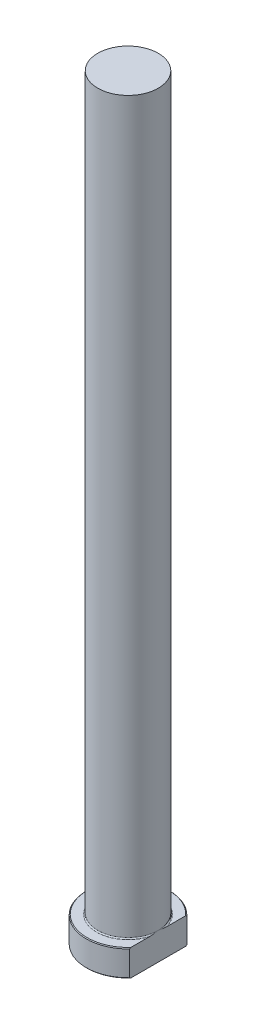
ISO-10303-21;
HEADER;
FILE_DESCRIPTION(('STEP AP214'),'2;1');
FILE_NAME('part.step','',(''),(''),'','','');
FILE_SCHEMA(('AUTOMOTIVE_DESIGN { 1 0 10303 214 1 1 1 1 }'));
ENDSEC;
DATA;
#1=APPLICATION_CONTEXT('core data for automotive mechanical design processes');
#2=APPLICATION_PROTOCOL_DEFINITION('international standard','automotive_design',2000,#1);
#3=PRODUCT_CONTEXT('',#1,'mechanical');
#4=PRODUCT('Part','Part','',(#3));
#5=PRODUCT_RELATED_PRODUCT_CATEGORY('part','',(#4));
#6=PRODUCT_DEFINITION_FORMATION('','',#4);
#7=PRODUCT_DEFINITION_CONTEXT('part definition',#1,'design');
#8=PRODUCT_DEFINITION('design','',#6,#7);
#9=PRODUCT_DEFINITION_SHAPE('','',#8);
#10=(LENGTH_UNIT() NAMED_UNIT(*) SI_UNIT(.MILLI.,.METRE.));
#11=(NAMED_UNIT(*) PLANE_ANGLE_UNIT() SI_UNIT($,.RADIAN.));
#12=(NAMED_UNIT(*) SI_UNIT($,.STERADIAN.) SOLID_ANGLE_UNIT());
#13=UNCERTAINTY_MEASURE_WITH_UNIT(LENGTH_MEASURE(1.E-05),#10,'distance_accuracy_value','');
#14=(GEOMETRIC_REPRESENTATION_CONTEXT(3) GLOBAL_UNCERTAINTY_ASSIGNED_CONTEXT((#13)) GLOBAL_UNIT_ASSIGNED_CONTEXT((#10,
#11,#12)) REPRESENTATION_CONTEXT('',''));
#15=CARTESIAN_POINT('',(0.,0.,0.));
#16=DIRECTION('',(0.,0.,1.));
#17=DIRECTION('',(1.,0.,0.));
#18=AXIS2_PLACEMENT_3D('',#15,#16,#17);
#19=CARTESIAN_POINT('',(0.,0.,0.));
#20=DIRECTION('',(0.,-1.,0.));
#21=DIRECTION('',(0.,0.,-1.));
#22=AXIS2_PLACEMENT_3D('',#19,#20,#21);
#23=PLANE('',#22);
#24=CARTESIAN_POINT('',(0.,0.,0.));
#25=DIRECTION('',(0.,-1.,0.));
#26=DIRECTION('',(0.,0.,-1.));
#27=AXIS2_PLACEMENT_3D('',#24,#25,#26);
#28=CIRCLE('',#27,10.7999999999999);
#29=CARTESIAN_POINT('',(7.99999999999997,0.,7.25534285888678));
#30=VERTEX_POINT('',#29);
#31=CARTESIAN_POINT('',(7.99999999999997,0.,-7.25534285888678));
#32=VERTEX_POINT('',#31);
#33=EDGE_CURVE('E98',#30,#32,#28,.T.);
#34=ORIENTED_EDGE('',*,*,#33,.T.);
#35=DIRECTION('',(0.,0.,1.));
#36=VECTOR('',#35,1.);
#37=CARTESIAN_POINT('',(7.99999999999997,0.,-7.54983443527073));
#38=LINE('',#37,#36);
#39=EDGE_CURVE('E83',#32,#30,#38,.T.);
#40=ORIENTED_EDGE('',*,*,#39,.T.);
#41=EDGE_LOOP('',(#34,#40));
#42=FACE_BOUND('',#41,.T.);
#43=ADVANCED_FACE('F32',(#42),#23,.T.);
#44=CARTESIAN_POINT('',(0.,259.958771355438,0.));
#45=DIRECTION('',(0.,1.,0.));
#46=DIRECTION('',(0.,0.,1.));
#47=AXIS2_PLACEMENT_3D('',#44,#45,#46);
#48=CYLINDRICAL_SURFACE('',#47,11.);
#49=CARTESIAN_POINT('',(0.,6.79999999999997,0.));
#50=DIRECTION('',(0.,1.,0.));
#51=DIRECTION('',(0.,0.,1.));
#52=AXIS2_PLACEMENT_3D('',#49,#50,#51);
#53=CIRCLE('',#52,11.);
#54=CARTESIAN_POINT('',(7.99999999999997,6.79999999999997,7.54983443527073));
#55=VERTEX_POINT('',#54);
#56=CARTESIAN_POINT('',(7.99999999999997,6.79999999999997,-7.54983443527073));
#57=VERTEX_POINT('',#56);
#58=EDGE_CURVE('E104',#55,#57,#53,.F.);
#59=ORIENTED_EDGE('',*,*,#58,.T.);
#60=DIRECTION('',(0.,-1.,0.));
#61=VECTOR('',#60,1.);
#62=CARTESIAN_POINT('',(7.99999999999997,200.,-7.54983443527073));
#63=LINE('',#62,#61);
#64=CARTESIAN_POINT('',(7.99999999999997,0.200000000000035,-7.54983443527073));
#65=VERTEX_POINT('',#64);
#66=EDGE_CURVE('E183',#57,#65,#63,.T.);
#67=ORIENTED_EDGE('',*,*,#66,.T.);
#68=CARTESIAN_POINT('',(0.,0.200000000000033,0.));
#69=DIRECTION('',(0.,-1.,0.));
#70=DIRECTION('',(0.,0.,-1.));
#71=AXIS2_PLACEMENT_3D('',#68,#69,#70);
#72=CIRCLE('',#71,11.);
#73=CARTESIAN_POINT('',(7.99999999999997,0.200000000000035,7.54983443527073));
#74=VERTEX_POINT('',#73);
#75=EDGE_CURVE('E100',#65,#74,#72,.F.);
#76=ORIENTED_EDGE('',*,*,#75,.T.);
#77=DIRECTION('',(0.,-1.,0.));
#78=VECTOR('',#77,1.);
#79=CARTESIAN_POINT('',(7.99999999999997,200.,7.54983443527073));
#80=LINE('',#79,#78);
#81=EDGE_CURVE('E93',#55,#74,#80,.T.);
#82=ORIENTED_EDGE('',*,*,#81,.F.);
#83=EDGE_LOOP('',(#59,#67,#76,#82));
#84=FACE_BOUND('',#83,.T.);
#85=ADVANCED_FACE('F158',(#84),#48,.T.);
#86=CARTESIAN_POINT('',(-11.,7.,0.));
#87=DIRECTION('',(0.,1.,0.));
#88=DIRECTION('',(0.,0.,1.));
#89=AXIS2_PLACEMENT_3D('',#86,#87,#88);
#90=PLANE('',#89);
#91=CARTESIAN_POINT('',(0.,7.,0.));
#92=DIRECTION('',(0.,1.,0.));
#93=DIRECTION('',(0.,0.,1.));
#94=AXIS2_PLACEMENT_3D('',#91,#92,#93);
#95=CIRCLE('',#94,10.8);
#96=CARTESIAN_POINT('',(7.99999999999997,7.,-7.25534285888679));
#97=VERTEX_POINT('',#96);
#98=CARTESIAN_POINT('',(7.99999999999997,7.,7.25534285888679));
#99=VERTEX_POINT('',#98);
#100=EDGE_CURVE('E178',#97,#99,#95,.T.);
#101=ORIENTED_EDGE('',*,*,#100,.T.);
#102=DIRECTION('',(0.,0.,-1.));
#103=VECTOR('',#102,1.);
#104=CARTESIAN_POINT('',(7.99999999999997,7.,0.));
#105=LINE('',#104,#103);
#106=CARTESIAN_POINT('',(7.99999999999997,6.99999999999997,2.21133443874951));
#107=VERTEX_POINT('',#106);
#108=EDGE_CURVE('E57',#99,#107,#105,.T.);
#109=ORIENTED_EDGE('',*,*,#108,.T.);
#110=CARTESIAN_POINT('',(0.,7.,0.));
#111=DIRECTION('',(0.,1.,0.));
#112=DIRECTION('',(0.,0.,1.));
#113=AXIS2_PLACEMENT_3D('',#110,#111,#112);
#114=CIRCLE('',#113,8.29999999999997);
#115=CARTESIAN_POINT('',(7.99999999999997,6.99999999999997,-2.21133443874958));
#116=VERTEX_POINT('',#115);
#117=EDGE_CURVE('E107',#107,#116,#114,.F.);
#118=ORIENTED_EDGE('',*,*,#117,.T.);
#119=EDGE_CURVE('E136',#116,#97,#105,.T.);
#120=ORIENTED_EDGE('',*,*,#119,.T.);
#121=EDGE_LOOP('',(#101,#109,#118,#120));
#122=FACE_BOUND('',#121,.T.);
#123=ADVANCED_FACE('F147',(#122),#90,.T.);
#124=CARTESIAN_POINT('',(0.,7.00000000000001,0.));
#125=DIRECTION('',(0.,-1.,0.));
#126=DIRECTION('',(0.,0.,-1.));
#127=AXIS2_PLACEMENT_3D('',#124,#125,#126);
#128=CONICAL_SURFACE('',#127,10.7999999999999,0.785398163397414);
#129=ORIENTED_EDGE('',*,*,#58,.F.);
#130=CARTESIAN_POINT('',(7.99999999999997,-0.636730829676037,16.6106304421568));
#131=CARTESIAN_POINT('',(7.99999999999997,-0.418611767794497,16.3685283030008));
#132=CARTESIAN_POINT('',(7.99999999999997,-0.200984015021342,16.1259843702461));
#133=CARTESIAN_POINT('',(7.99999999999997,0.233148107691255,15.6398927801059));
#134=CARTESIAN_POINT('',(7.99999999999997,0.449652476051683,15.3963451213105));
#135=CARTESIAN_POINT('',(7.99999999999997,1.09739989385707,14.6638687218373));
#136=CARTESIAN_POINT('',(7.99999999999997,1.52674426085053,14.1732538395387));
#137=CARTESIAN_POINT('',(7.99999999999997,2.16792810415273,13.4304656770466));
#138=CARTESIAN_POINT('',(7.99999999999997,2.38226067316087,13.180443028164));
#139=CARTESIAN_POINT('',(7.99999999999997,2.80892954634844,12.6787083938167));
#140=CARTESIAN_POINT('',(7.99999999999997,3.02126589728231,12.4269964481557));
#141=CARTESIAN_POINT('',(7.99999999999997,3.44357020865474,11.9216744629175));
#142=CARTESIAN_POINT('',(7.99999999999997,3.6535386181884,11.6680647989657));
#143=CARTESIAN_POINT('',(7.99999999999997,4.07074862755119,11.1585723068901));
#144=CARTESIAN_POINT('',(7.99999999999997,4.27798998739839,10.9026892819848));
#145=CARTESIAN_POINT('',(7.99999999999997,4.66965190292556,10.4127607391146));
#146=CARTESIAN_POINT('',(7.99999999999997,4.85436868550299,10.1789522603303));
#147=CARTESIAN_POINT('',(7.99999999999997,5.22063517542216,9.70886883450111));
#148=CARTESIAN_POINT('',(7.99999999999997,5.4021849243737,9.47259391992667));
#149=CARTESIAN_POINT('',(7.99999999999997,5.76149237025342,8.99721569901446));
#150=CARTESIAN_POINT('',(7.99999999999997,5.93925050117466,8.75811272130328));
#151=CARTESIAN_POINT('',(7.99999999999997,6.29022306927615,8.276601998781));
#152=CARTESIAN_POINT('',(7.99999999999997,6.46343768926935,8.03419438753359));
#153=CARTESIAN_POINT('',(7.99999999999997,6.80398487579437,7.54604999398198));
#154=CARTESIAN_POINT('',(7.99999999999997,6.97132935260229,7.3003215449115));
#155=CARTESIAN_POINT('',(7.99999999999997,7.29928849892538,6.80437777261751));
#156=CARTESIAN_POINT('',(7.99999999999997,7.45990280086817,6.55416220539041));
#157=CARTESIAN_POINT('',(7.99999999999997,7.77264940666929,6.04873149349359));
#158=CARTESIAN_POINT('',(7.99999999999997,7.92478824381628,5.79352041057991));
#159=CARTESIAN_POINT('',(7.99999999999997,8.21859570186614,5.27715744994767));
#160=CARTESIAN_POINT('',(7.99999999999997,8.36026610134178,5.01600659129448));
#161=CARTESIAN_POINT('',(7.99999999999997,8.62213596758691,4.50319242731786));
#162=CARTESIAN_POINT('',(7.99999999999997,8.74311989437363,4.25193242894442));
#163=CARTESIAN_POINT('',(7.99999999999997,8.97065709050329,3.74287674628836));
#164=CARTESIAN_POINT('',(7.99999999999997,9.07720941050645,3.48508063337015));
#165=CARTESIAN_POINT('',(7.99999999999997,9.27220860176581,2.96337495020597));
#166=CARTESIAN_POINT('',(7.99999999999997,9.36069936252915,2.69948197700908));
#167=CARTESIAN_POINT('',(7.99999999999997,9.51604316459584,2.16542713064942));
#168=CARTESIAN_POINT('',(7.99999999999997,9.58290677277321,1.89526838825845));
#169=CARTESIAN_POINT('',(7.99999999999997,9.68291221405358,1.39216000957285));
#170=CARTESIAN_POINT('',(7.99999999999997,9.71967474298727,1.15993430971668));
#171=CARTESIAN_POINT('',(7.99999999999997,9.77336730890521,0.69319665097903));
#172=CARTESIAN_POINT('',(7.99999999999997,9.7903003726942,0.458685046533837));
#173=CARTESIAN_POINT('',(7.99999999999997,9.8034285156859,-0.0106727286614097));
#174=CARTESIAN_POINT('',(7.99999999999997,9.79964609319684,-0.245518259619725));
#175=CARTESIAN_POINT('',(7.99999999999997,9.77160926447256,-0.713989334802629));
#176=CARTESIAN_POINT('',(7.99999999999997,9.74735189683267,-0.94761469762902));
#177=CARTESIAN_POINT('',(7.99999999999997,9.67070830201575,-1.47287443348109));
#178=CARTESIAN_POINT('',(7.99999999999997,9.61261890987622,-1.76367634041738));
#179=CARTESIAN_POINT('',(7.99999999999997,9.46982192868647,-2.33873282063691));
#180=CARTESIAN_POINT('',(7.99999999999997,9.38509750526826,-2.62298313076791));
#181=CARTESIAN_POINT('',(7.99999999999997,9.24134311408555,-3.04436856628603));
#182=CARTESIAN_POINT('',(7.99999999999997,9.19048552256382,-3.18437323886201));
#183=CARTESIAN_POINT('',(7.99999999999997,9.0838167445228,-3.4624156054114));
#184=CARTESIAN_POINT('',(7.99999999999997,9.0280078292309,-3.60045416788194));
#185=CARTESIAN_POINT('',(7.99999999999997,8.91195481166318,-3.87463242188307));
#186=CARTESIAN_POINT('',(7.99999999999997,8.85171106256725,-4.01077226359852));
#187=CARTESIAN_POINT('',(7.99999999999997,8.72725899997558,-4.28124317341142));
#188=CARTESIAN_POINT('',(7.99999999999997,8.66305017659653,-4.41557400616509));
#189=CARTESIAN_POINT('',(7.99999999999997,8.48984738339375,-4.76597692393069));
#190=CARTESIAN_POINT('',(7.99999999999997,8.37796178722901,-4.98062176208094));
#191=CARTESIAN_POINT('',(7.99999999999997,8.14649205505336,-5.40573762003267));
#192=CARTESIAN_POINT('',(7.99999999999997,8.02690659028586,-5.61620791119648));
#193=CARTESIAN_POINT('',(7.99999999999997,7.78128707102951,-6.03349586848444));
#194=CARTESIAN_POINT('',(7.99999999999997,7.65524949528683,-6.24031145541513));
#195=CARTESIAN_POINT('',(7.99999999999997,7.39783636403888,-6.65060320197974));
#196=CARTESIAN_POINT('',(7.99999999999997,7.26646042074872,-6.85407911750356));
#197=CARTESIAN_POINT('',(7.99999999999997,6.99890352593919,-7.25856399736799));
#198=CARTESIAN_POINT('',(7.99999999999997,6.86271149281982,-7.45956561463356));
#199=CARTESIAN_POINT('',(7.99999999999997,6.58651908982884,-7.85893907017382));
#200=CARTESIAN_POINT('',(7.99999999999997,6.4465185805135,-8.05731081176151));
#201=CARTESIAN_POINT('',(7.99999999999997,6.02178241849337,-8.6488124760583));
#202=CARTESIAN_POINT('',(7.99999999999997,5.73221467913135,-9.03847436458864));
#203=CARTESIAN_POINT('',(7.99999999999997,5.14234581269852,-9.8121850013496));
#204=CARTESIAN_POINT('',(7.99999999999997,4.84200393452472,-10.1962024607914));
#205=CARTESIAN_POINT('',(7.99999999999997,4.23404813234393,-10.9584616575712));
#206=CARTESIAN_POINT('',(7.99999999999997,3.92643376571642,-11.336703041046));
#207=CARTESIAN_POINT('',(7.99999999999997,3.30600745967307,-12.0880358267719));
#208=CARTESIAN_POINT('',(7.99999999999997,2.99320302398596,-12.4611334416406));
#209=CARTESIAN_POINT('',(7.99999999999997,2.36317801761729,-13.2035599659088));
#210=CARTESIAN_POINT('',(7.99999999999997,2.04595754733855,-13.5728889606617));
#211=CARTESIAN_POINT('',(7.99999999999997,1.33644011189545,-14.3909378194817));
#212=CARTESIAN_POINT('',(7.99999999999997,0.943258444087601,-14.8388897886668));
#213=CARTESIAN_POINT('',(7.99999999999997,0.35148359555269,-15.506812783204));
#214=CARTESIAN_POINT('',(7.99999999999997,0.154449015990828,-15.7281687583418));
#215=CARTESIAN_POINT('',(7.99999999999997,-0.240498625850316,-16.1700151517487));
#216=CARTESIAN_POINT('',(7.99999999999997,-0.438411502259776,-16.390505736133));
#217=CARTESIAN_POINT('',(7.99999999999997,-0.636730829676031,-16.6106304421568));
#218=B_SPLINE_CURVE_WITH_KNOTS('',3,(#130,#131,#132,#133,#134,#135,#136,#137,#138,#139,#140,
#141,#142,#143,#144,#145,#146,#147,#148,#149,#150,#151,#152,#153,#154,#155,#156,#157,#158,#159,
#160,#161,#162,#163,#164,#165,#166,#167,#168,#169,#170,#171,#172,#173,#174,#175,#176,#177,#178,
#179,#180,#181,#182,#183,#184,#185,#186,#187,#188,#189,#190,#191,#192,#193,#194,#195,#196,#197,
#198,#199,#200,#201,#202,#203,#204,#205,#206,#207,#208,#209,#210,#211,#212,#213,#214,#215,#216,
#217),.UNSPECIFIED.,.F.,.F.,(4,2,2,2,2,2,2,2,2,2,2,2,2,2,2,2,2,2,2,2,2,2,2,2,2,2,2,2,2,2,2,2,2,
2,2,2,2,2,2,2,2,2,2,4),(0.,0.977598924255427,1.95519922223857,3.91099512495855,4.89893858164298,
5.88685884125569,6.87458847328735,7.86240445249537,8.75629469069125,9.65017317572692,
10.5439487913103,11.4376883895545,12.3294952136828,13.2213506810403,14.1125088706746,
15.0035153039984,15.8397621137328,16.6760639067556,17.5103086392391,18.3441451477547,
19.0487229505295,19.7531931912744,20.4568984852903,21.1607055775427,22.0488428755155,
22.9375426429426,23.3843335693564,23.830920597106,24.2774720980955,24.72408114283,
25.4500411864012,26.1761268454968,26.902613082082,27.6291521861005,28.3574884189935,
29.0858513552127,30.5420520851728,32.0045059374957,33.4670490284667,34.9276355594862,
36.3881889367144,38.1762452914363,39.0652821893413,39.9541391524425),.UNSPECIFIED.);
#219=EDGE_CURVE('E135',#55,#99,#218,.T.);
#220=ORIENTED_EDGE('',*,*,#219,.T.);
#221=ORIENTED_EDGE('',*,*,#100,.F.);
#222=EDGE_CURVE('E127',#97,#57,#218,.T.);
#223=ORIENTED_EDGE('',*,*,#222,.T.);
#224=EDGE_LOOP('',(#129,#220,#221,#223));
#225=FACE_BOUND('',#224,.T.);
#226=ADVANCED_FACE('F143',(#225),#128,.T.);
#227=CARTESIAN_POINT('',(0.,0.200000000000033,0.));
#228=DIRECTION('',(0.,1.,0.));
#229=DIRECTION('',(0.,0.,1.));
#230=AXIS2_PLACEMENT_3D('',#227,#228,#229);
#231=CONICAL_SURFACE('',#230,11.,0.785398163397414);
#232=ORIENTED_EDGE('',*,*,#75,.F.);
#233=CARTESIAN_POINT('',(7.99999999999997,7.63673082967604,-16.6106304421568));
#234=CARTESIAN_POINT('',(7.99999999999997,7.4186117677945,-16.3685283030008));
#235=CARTESIAN_POINT('',(7.99999999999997,7.20098401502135,-16.1259843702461));
#236=CARTESIAN_POINT('',(7.99999999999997,6.76685189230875,-15.6398927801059));
#237=CARTESIAN_POINT('',(7.99999999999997,6.55034752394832,-15.3963451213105));
#238=CARTESIAN_POINT('',(7.99999999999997,5.90260010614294,-14.6638687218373));
#239=CARTESIAN_POINT('',(7.99999999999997,5.47325573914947,-14.1732538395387));
#240=CARTESIAN_POINT('',(7.99999999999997,4.83207189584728,-13.4304656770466));
#241=CARTESIAN_POINT('',(7.99999999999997,4.61773932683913,-13.180443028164));
#242=CARTESIAN_POINT('',(7.99999999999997,4.19107045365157,-12.6787083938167));
#243=CARTESIAN_POINT('',(7.99999999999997,3.9787341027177,-12.4269964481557));
#244=CARTESIAN_POINT('',(7.99999999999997,3.55642979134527,-11.9216744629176));
#245=CARTESIAN_POINT('',(7.99999999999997,3.34646138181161,-11.6680647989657));
#246=CARTESIAN_POINT('',(7.99999999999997,2.92925137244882,-11.1585723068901));
#247=CARTESIAN_POINT('',(7.99999999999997,2.72201001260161,-10.9026892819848));
#248=CARTESIAN_POINT('',(7.99999999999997,2.33034809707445,-10.4127607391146));
#249=CARTESIAN_POINT('',(7.99999999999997,2.14563131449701,-10.1789522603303));
#250=CARTESIAN_POINT('',(7.99999999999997,1.77936482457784,-9.70886883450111));
#251=CARTESIAN_POINT('',(7.99999999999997,1.59781507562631,-9.47259391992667));
#252=CARTESIAN_POINT('',(7.99999999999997,1.23850762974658,-8.99721569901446));
#253=CARTESIAN_POINT('',(7.99999999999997,1.06074949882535,-8.75811272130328));
#254=CARTESIAN_POINT('',(7.99999999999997,0.709776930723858,-8.276601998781));
#255=CARTESIAN_POINT('',(7.99999999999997,0.536562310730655,-8.03419438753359));
#256=CARTESIAN_POINT('',(7.99999999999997,0.196015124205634,-7.54604999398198));
#257=CARTESIAN_POINT('',(7.99999999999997,0.0286706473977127,-7.3003215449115));
#258=CARTESIAN_POINT('',(7.99999999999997,-0.299288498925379,-6.80437777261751));
#259=CARTESIAN_POINT('',(7.99999999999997,-0.459902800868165,-6.55416220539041));
#260=CARTESIAN_POINT('',(7.99999999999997,-0.772649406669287,-6.04873149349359));
#261=CARTESIAN_POINT('',(7.99999999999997,-0.924788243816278,-5.7935204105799));
#262=CARTESIAN_POINT('',(7.99999999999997,-1.21859570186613,-5.27715744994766));
#263=CARTESIAN_POINT('',(7.99999999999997,-1.36026610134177,-5.01600659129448));
#264=CARTESIAN_POINT('',(7.99999999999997,-1.62213596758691,-4.50319242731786));
#265=CARTESIAN_POINT('',(7.99999999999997,-1.74311989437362,-4.25193242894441));
#266=CARTESIAN_POINT('',(7.99999999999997,-1.97065709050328,-3.74287674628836));
#267=CARTESIAN_POINT('',(7.99999999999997,-2.07720941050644,-3.48508063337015));
#268=CARTESIAN_POINT('',(7.99999999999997,-2.27220860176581,-2.96337495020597));
#269=CARTESIAN_POINT('',(7.99999999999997,-2.36069936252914,-2.69948197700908));
#270=CARTESIAN_POINT('',(7.99999999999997,-2.51604316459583,-2.16542713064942));
#271=CARTESIAN_POINT('',(7.99999999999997,-2.58290677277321,-1.89526838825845));
#272=CARTESIAN_POINT('',(7.99999999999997,-2.68291221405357,-1.39216000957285));
#273=CARTESIAN_POINT('',(7.99999999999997,-2.71967474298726,-1.15993430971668));
#274=CARTESIAN_POINT('',(7.99999999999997,-2.77336730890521,-0.693196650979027));
#275=CARTESIAN_POINT('',(7.99999999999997,-2.7903003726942,-0.458685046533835));
#276=CARTESIAN_POINT('',(7.99999999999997,-2.80342851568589,0.0106727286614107));
#277=CARTESIAN_POINT('',(7.99999999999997,-2.79964609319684,0.245518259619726));
#278=CARTESIAN_POINT('',(7.99999999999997,-2.77160926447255,0.71398933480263));
#279=CARTESIAN_POINT('',(7.99999999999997,-2.74735189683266,0.94761469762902));
#280=CARTESIAN_POINT('',(7.99999999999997,-2.67070830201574,1.47287443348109));
#281=CARTESIAN_POINT('',(7.99999999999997,-2.61261890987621,1.76367634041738));
#282=CARTESIAN_POINT('',(7.99999999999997,-2.46982192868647,2.33873282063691));
#283=CARTESIAN_POINT('',(7.99999999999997,-2.38509750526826,2.62298313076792));
#284=CARTESIAN_POINT('',(7.99999999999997,-2.24134311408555,3.04436856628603));
#285=CARTESIAN_POINT('',(7.99999999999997,-2.19048552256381,3.184373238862));
#286=CARTESIAN_POINT('',(7.99999999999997,-2.08381674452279,3.46241560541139));
#287=CARTESIAN_POINT('',(7.99999999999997,-2.02800782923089,3.60045416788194));
#288=CARTESIAN_POINT('',(7.99999999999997,-1.91195481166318,3.87463242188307));
#289=CARTESIAN_POINT('',(7.99999999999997,-1.85171106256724,4.01077226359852));
#290=CARTESIAN_POINT('',(7.99999999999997,-1.72725899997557,4.28124317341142));
#291=CARTESIAN_POINT('',(7.99999999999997,-1.66305017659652,4.4155740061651));
#292=CARTESIAN_POINT('',(7.99999999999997,-1.48984738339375,4.76597692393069));
#293=CARTESIAN_POINT('',(7.99999999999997,-1.377961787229,4.98062176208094));
#294=CARTESIAN_POINT('',(7.99999999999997,-1.14649205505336,5.40573762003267));
#295=CARTESIAN_POINT('',(7.99999999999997,-1.02690659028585,5.61620791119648));
#296=CARTESIAN_POINT('',(7.99999999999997,-0.781287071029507,6.03349586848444));
#297=CARTESIAN_POINT('',(7.99999999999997,-0.655249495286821,6.24031145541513));
#298=CARTESIAN_POINT('',(7.99999999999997,-0.397836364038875,6.65060320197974));
#299=CARTESIAN_POINT('',(7.99999999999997,-0.266460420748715,6.85407911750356));
#300=CARTESIAN_POINT('',(7.99999999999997,0.00109647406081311,7.25856399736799));
#301=CARTESIAN_POINT('',(7.99999999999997,0.137288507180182,7.45956561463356));
#302=CARTESIAN_POINT('',(7.99999999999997,0.413480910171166,7.85893907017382));
#303=CARTESIAN_POINT('',(7.99999999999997,0.553481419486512,8.05731081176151));
#304=CARTESIAN_POINT('',(7.99999999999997,0.978217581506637,8.6488124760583));
#305=CARTESIAN_POINT('',(7.99999999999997,1.26778532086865,9.03847436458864));
#306=CARTESIAN_POINT('',(7.99999999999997,1.85765418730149,9.8121850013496));
#307=CARTESIAN_POINT('',(7.99999999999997,2.15799606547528,10.1962024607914));
#308=CARTESIAN_POINT('',(7.99999999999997,2.76595186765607,10.9584616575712));
#309=CARTESIAN_POINT('',(7.99999999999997,3.07356623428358,11.3367030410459));
#310=CARTESIAN_POINT('',(7.99999999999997,3.69399254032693,12.0880358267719));
#311=CARTESIAN_POINT('',(7.99999999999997,4.00679697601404,12.4611334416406));
#312=CARTESIAN_POINT('',(7.99999999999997,4.63682198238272,13.2035599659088));
#313=CARTESIAN_POINT('',(7.99999999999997,4.95404245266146,13.5728889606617));
#314=CARTESIAN_POINT('',(7.99999999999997,5.66355988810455,14.3909378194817));
#315=CARTESIAN_POINT('',(7.99999999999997,6.0567415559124,14.8388897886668));
#316=CARTESIAN_POINT('',(7.99999999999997,6.64851640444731,15.506812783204));
#317=CARTESIAN_POINT('',(7.99999999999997,6.84555098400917,15.7281687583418));
#318=CARTESIAN_POINT('',(7.99999999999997,7.24049862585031,16.1700151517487));
#319=CARTESIAN_POINT('',(7.99999999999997,7.43841150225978,16.390505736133));
#320=CARTESIAN_POINT('',(7.99999999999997,7.63673082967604,16.6106304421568));
#321=B_SPLINE_CURVE_WITH_KNOTS('',3,(#233,#234,#235,#236,#237,#238,#239,#240,#241,#242,#243,
#244,#245,#246,#247,#248,#249,#250,#251,#252,#253,#254,#255,#256,#257,#258,#259,#260,#261,#262,
#263,#264,#265,#266,#267,#268,#269,#270,#271,#272,#273,#274,#275,#276,#277,#278,#279,#280,#281,
#282,#283,#284,#285,#286,#287,#288,#289,#290,#291,#292,#293,#294,#295,#296,#297,#298,#299,#300,
#301,#302,#303,#304,#305,#306,#307,#308,#309,#310,#311,#312,#313,#314,#315,#316,#317,#318,#319,
#320),.UNSPECIFIED.,.F.,.F.,(4,2,2,2,2,2,2,2,2,2,2,2,2,2,2,2,2,2,2,2,2,2,2,2,2,2,2,2,2,2,2,2,2,
2,2,2,2,2,2,2,2,2,2,4),(0.,0.977598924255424,1.95519922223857,3.91099512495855,4.89893858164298,
5.88685884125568,6.87458847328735,7.86240445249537,8.75629469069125,9.65017317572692,
10.5439487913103,11.4376883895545,12.3294952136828,13.2213506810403,14.1125088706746,
15.0035153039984,15.8397621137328,16.6760639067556,17.5103086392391,18.3441451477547,
19.0487229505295,19.7531931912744,20.4568984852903,21.1607055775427,22.0488428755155,
22.9375426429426,23.3843335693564,23.830920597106,24.2774720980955,24.72408114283,
25.4500411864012,26.1761268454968,26.902613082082,27.6291521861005,28.3574884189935,
29.0858513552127,30.5420520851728,32.0045059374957,33.4670490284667,34.9276355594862,
36.3881889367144,38.1762452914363,39.0652821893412,39.9541391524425),.UNSPECIFIED.);
#322=EDGE_CURVE('E86',#65,#32,#321,.T.);
#323=ORIENTED_EDGE('',*,*,#322,.T.);
#324=ORIENTED_EDGE('',*,*,#33,.F.);
#325=EDGE_CURVE('E89',#30,#74,#321,.T.);
#326=ORIENTED_EDGE('',*,*,#325,.T.);
#327=EDGE_LOOP('',(#232,#323,#324,#326));
#328=FACE_BOUND('',#327,.T.);
#329=ADVANCED_FACE('F97',(#328),#231,.T.);
#330=CARTESIAN_POINT('',(0.,7.29999999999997,0.));
#331=DIRECTION('',(0.,1.,0.));
#332=DIRECTION('',(0.,0.,1.));
#333=AXIS2_PLACEMENT_3D('',#330,#331,#332);
#334=TOROIDAL_SURFACE('',#333,8.29999999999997,0.3);
#335=CARTESIAN_POINT('',(7.99999999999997,7.29999999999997,0.));
#336=CARTESIAN_POINT('',(7.99999999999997,7.30000062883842,1.41343368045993E-10));
#337=CARTESIAN_POINT('',(7.99999999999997,7.30000125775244,-3.45355322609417E-07));
#338=CARTESIAN_POINT('',(7.99999999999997,7.30000241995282,-1.23398463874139E-06));
#339=CARTESIAN_POINT('',(7.99999999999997,7.30000291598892,-1.80141989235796E-06));
#340=CARTESIAN_POINT('',(7.99999999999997,7.30000399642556,-3.18390842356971E-06));
#341=CARTESIAN_POINT('',(7.99999999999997,7.30000456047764,-4.02115832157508E-06));
#342=CARTESIAN_POINT('',(7.99999999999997,7.30000552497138,-5.71072460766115E-06));
#343=CARTESIAN_POINT('',(7.99999999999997,7.30000593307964,-6.55926444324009E-06));
#344=CARTESIAN_POINT('',(7.99999999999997,7.30000755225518,-1.000964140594E-05));
#345=CARTESIAN_POINT('',(7.99999999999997,7.30000869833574,-1.26477244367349E-05));
#346=CARTESIAN_POINT('',(7.99999999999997,7.30001047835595,-1.77422280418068E-05));
#347=CARTESIAN_POINT('',(7.99999999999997,7.30001115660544,-2.01836505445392E-05));
#348=CARTESIAN_POINT('',(7.99999999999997,7.30001417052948,-3.09435594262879E-05));
#349=CARTESIAN_POINT('',(7.99999999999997,7.30001656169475,-3.92473415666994E-05));
#350=CARTESIAN_POINT('',(7.99999999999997,7.30001991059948,-5.46311733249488E-05));
#351=CARTESIAN_POINT('',(7.99999999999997,7.30002104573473,-6.16717033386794E-05));
#352=CARTESIAN_POINT('',(7.99999999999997,7.30002955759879,-0.000115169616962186));
#353=CARTESIAN_POINT('',(7.99999999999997,7.30003630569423,-0.000161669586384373));
#354=CARTESIAN_POINT('',(7.99999999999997,7.30006581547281,-0.00034712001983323));
#355=CARTESIAN_POINT('',(7.99999999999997,7.30009364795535,-0.000485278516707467));
#356=CARTESIAN_POINT('',(7.99999999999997,7.30020325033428,-0.00103711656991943));
#357=CARTESIAN_POINT('',(7.99999999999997,7.30028197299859,-0.00145117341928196));
#358=CARTESIAN_POINT('',(7.99999999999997,7.30059973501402,-0.00311182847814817));
#359=CARTESIAN_POINT('',(7.99999999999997,7.30084275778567,-0.00435790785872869));
#360=CARTESIAN_POINT('',(7.99999999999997,7.30186073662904,-0.00958966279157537));
#361=CARTESIAN_POINT('',(7.99999999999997,7.30263061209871,-0.0135760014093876));
#362=CARTESIAN_POINT('',(7.99999999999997,7.30870312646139,-0.0450030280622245));
#363=CARTESIAN_POINT('',(7.99999999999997,7.31402334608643,-0.0724414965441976));
#364=CARTESIAN_POINT('',(7.99999999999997,7.32442239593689,-0.126197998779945));
#365=CARTESIAN_POINT('',(7.99999999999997,7.32950218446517,-0.152515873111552));
#366=CARTESIAN_POINT('',(7.99999999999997,7.34609783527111,-0.23868034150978));
#367=CARTESIAN_POINT('',(7.99999999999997,7.35757011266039,-0.29853557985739));
#368=CARTESIAN_POINT('',(7.99999999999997,7.37688511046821,-0.400403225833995));
#369=CARTESIAN_POINT('',(7.99999999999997,7.38478827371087,-0.442404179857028));
#370=CARTESIAN_POINT('',(7.99999999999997,7.40022249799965,-0.525284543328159));
#371=CARTESIAN_POINT('',(7.99999999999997,7.40775782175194,-0.566163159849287));
#372=CARTESIAN_POINT('',(7.99999999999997,7.4322438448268,-0.700743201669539));
#373=CARTESIAN_POINT('',(7.99999999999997,7.44879297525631,-0.794518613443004));
#374=CARTESIAN_POINT('',(7.99999999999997,7.48053424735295,-0.983225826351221));
#375=CARTESIAN_POINT('',(7.99999999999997,7.49571186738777,-1.07816009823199));
#376=CARTESIAN_POINT('',(7.99999999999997,7.52532008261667,-1.27781321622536));
#377=CARTESIAN_POINT('',(7.99999999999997,7.53952614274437,-1.38256589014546));
#378=CARTESIAN_POINT('',(7.99999999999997,7.564310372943,-1.59223320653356));
#379=CARTESIAN_POINT('',(7.99999999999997,7.57489817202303,-1.6971466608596));
#380=CARTESIAN_POINT('',(7.99999999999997,7.58780012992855,-1.86417161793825));
#381=CARTESIAN_POINT('',(7.99999999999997,7.59172630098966,-1.92615747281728));
#382=CARTESIAN_POINT('',(7.99999999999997,7.59748111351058,-2.05022364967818));
#383=CARTESIAN_POINT('',(7.99999999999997,7.59931001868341,-2.11230395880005));
#384=CARTESIAN_POINT('',(7.99999999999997,7.60036180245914,-2.23528941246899));
#385=CARTESIAN_POINT('',(7.99999999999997,7.59963462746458,-2.29619395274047));
#386=CARTESIAN_POINT('',(7.99999999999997,7.59500883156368,-2.41785147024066));
#387=CARTESIAN_POINT('',(7.99999999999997,7.59111224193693,-2.47860451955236));
#388=CARTESIAN_POINT('',(7.99999999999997,7.57906933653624,-2.60042626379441));
#389=CARTESIAN_POINT('',(7.99999999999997,7.570876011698,-2.66149089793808));
#390=CARTESIAN_POINT('',(7.99999999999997,7.55390997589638,-2.7523359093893));
#391=CARTESIAN_POINT('',(7.99999999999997,7.54745990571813,-2.78254437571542));
#392=CARTESIAN_POINT('',(7.99999999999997,7.5325641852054,-2.84244543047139));
#393=CARTESIAN_POINT('',(7.99999999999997,7.52412026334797,-2.87213844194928));
#394=CARTESIAN_POINT('',(7.99999999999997,7.50454333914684,-2.93081083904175));
#395=CARTESIAN_POINT('',(7.99999999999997,7.4933995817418,-2.95978684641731));
#396=CARTESIAN_POINT('',(7.99999999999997,7.47379430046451,-3.00191342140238));
#397=CARTESIAN_POINT('',(7.99999999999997,7.46677809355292,-3.01573193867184));
#398=CARTESIAN_POINT('',(7.99999999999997,7.45153430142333,-3.04267574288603));
#399=CARTESIAN_POINT('',(7.99999999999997,7.44330842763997,-3.05580197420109));
#400=CARTESIAN_POINT('',(7.99999999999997,7.42520334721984,-3.0811225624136));
#401=CARTESIAN_POINT('',(7.99999999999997,7.41530529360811,-3.09330368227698));
#402=CARTESIAN_POINT('',(7.99999999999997,7.39348961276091,-3.11567039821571));
#403=CARTESIAN_POINT('',(7.99999999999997,7.38158911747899,-3.12587146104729));
#404=CARTESIAN_POINT('',(7.99999999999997,7.3626809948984,-3.13802739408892));
#405=CARTESIAN_POINT('',(7.99999999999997,7.35660667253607,-3.14142291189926));
#406=CARTESIAN_POINT('',(7.99999999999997,7.34401523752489,-3.14727797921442));
#407=CARTESIAN_POINT('',(7.99999999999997,7.33749832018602,-3.14973793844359));
#408=CARTESIAN_POINT('',(7.99999999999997,7.32406766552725,-3.15352036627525));
#409=CARTESIAN_POINT('',(7.99999999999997,7.31715078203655,-3.15483196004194));
#410=CARTESIAN_POINT('',(7.99999999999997,7.30319454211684,-3.15612126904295));
#411=CARTESIAN_POINT('',(7.99999999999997,7.29615528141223,-3.15609998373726));
#412=CARTESIAN_POINT('',(7.99999999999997,7.28287791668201,-3.15479583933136));
#413=CARTESIAN_POINT('',(7.99999999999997,7.27662738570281,-3.15363338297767));
#414=CARTESIAN_POINT('',(7.99999999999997,7.26438977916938,-3.15033645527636));
#415=CARTESIAN_POINT('',(7.99999999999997,7.25840290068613,-3.14820126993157));
#416=CARTESIAN_POINT('',(7.99999999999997,7.24428488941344,-3.14202752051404));
#417=CARTESIAN_POINT('',(7.99999999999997,7.2363403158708,-3.13756526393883));
#418=CARTESIAN_POINT('',(7.99999999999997,7.22124755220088,-3.1274544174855));
#419=CARTESIAN_POINT('',(7.99999999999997,7.21410153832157,-3.12180270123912));
#420=CARTESIAN_POINT('',(7.99999999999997,7.19559955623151,-3.10524942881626));
#421=CARTESIAN_POINT('',(7.99999999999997,7.18498382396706,-3.09352989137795));
#422=CARTESIAN_POINT('',(7.99999999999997,7.16550497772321,-3.068745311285));
#423=CARTESIAN_POINT('',(7.99999999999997,7.15664572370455,-3.05567739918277));
#424=CARTESIAN_POINT('',(7.99999999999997,7.13735489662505,-3.02391619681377));
#425=CARTESIAN_POINT('',(7.99999999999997,7.12749252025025,-3.00488123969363));
#426=CARTESIAN_POINT('',(7.99999999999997,7.10958189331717,-2.96596235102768));
#427=CARTESIAN_POINT('',(7.99999999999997,7.10153733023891,-2.9460767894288));
#428=CARTESIAN_POINT('',(7.99999999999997,7.08679055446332,-2.90559744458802));
#429=CARTESIAN_POINT('',(7.99999999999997,7.08010240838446,-2.88499860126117));
#430=CARTESIAN_POINT('',(7.99999999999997,7.06789000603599,-2.84348873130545));
#431=CARTESIAN_POINT('',(7.99999999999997,7.06236453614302,-2.8225780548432));
#432=CARTESIAN_POINT('',(7.99999999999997,7.04913807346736,-2.76752236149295));
#433=CARTESIAN_POINT('',(7.99999999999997,7.04220598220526,-2.73319311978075));
#434=CARTESIAN_POINT('',(7.99999999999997,7.0302605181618,-2.66419726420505));
#435=CARTESIAN_POINT('',(7.99999999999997,7.02524820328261,-2.62953047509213));
#436=CARTESIAN_POINT('',(7.99999999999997,7.0124950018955,-2.52504816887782));
#437=CARTESIAN_POINT('',(7.99999999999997,7.00708017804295,-2.45494936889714));
#438=CARTESIAN_POINT('',(7.99999999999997,7.000733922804,-2.31725135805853));
#439=CARTESIAN_POINT('',(7.99999999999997,6.99964073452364,-2.24965783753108));
#440=CARTESIAN_POINT('',(7.99999999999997,7.00055672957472,-2.11488194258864));
#441=CARTESIAN_POINT('',(7.99999999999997,7.00254831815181,-2.04769941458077));
#442=CARTESIAN_POINT('',(7.99999999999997,7.00911662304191,-1.91019632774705));
#443=CARTESIAN_POINT('',(7.99999999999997,7.01381425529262,-1.83988191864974));
#444=CARTESIAN_POINT('',(7.99999999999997,7.02534418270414,-1.69947139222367));
#445=CARTESIAN_POINT('',(7.99999999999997,7.0321753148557,-1.62937517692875));
#446=CARTESIAN_POINT('',(7.99999999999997,7.04774659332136,-1.48770318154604));
#447=CARTESIAN_POINT('',(7.99999999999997,7.05652844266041,-1.41613205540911));
#448=CARTESIAN_POINT('',(7.99999999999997,7.0755719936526,-1.2729917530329));
#449=CARTESIAN_POINT('',(7.99999999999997,7.08583764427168,-1.20142310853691));
#450=CARTESIAN_POINT('',(7.99999999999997,7.11167035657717,-1.03117663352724));
#451=CARTESIAN_POINT('',(7.99999999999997,7.12776522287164,-0.932579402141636));
#452=CARTESIAN_POINT('',(7.99999999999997,7.16130143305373,-0.736797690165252));
#453=CARTESIAN_POINT('',(7.99999999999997,7.1787249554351,-0.639610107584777));
#454=CARTESIAN_POINT('',(7.99999999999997,7.21241690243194,-0.456833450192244));
#455=CARTESIAN_POINT('',(7.99999999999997,7.22858010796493,-0.37122483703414));
#456=CARTESIAN_POINT('',(7.99999999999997,7.25353789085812,-0.240583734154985));
#457=CARTESIAN_POINT('',(7.99999999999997,7.26219901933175,-0.195525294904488));
#458=CARTESIAN_POINT('',(7.99999999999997,7.27945035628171,-0.106166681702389));
#459=CARTESIAN_POINT('',(7.99999999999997,7.28803936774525,-0.0618662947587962));
#460=CARTESIAN_POINT('',(7.99999999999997,7.29737150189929,-0.0135646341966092));
#461=CARTESIAN_POINT('',(7.99999999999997,7.29814363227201,-0.0095669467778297));
#462=CARTESIAN_POINT('',(7.99999999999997,7.29916212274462,-0.0043326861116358));
#463=CARTESIAN_POINT('',(7.99999999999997,7.29940341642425,-0.003095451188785));
#464=CARTESIAN_POINT('',(7.99999999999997,7.29971907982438,-0.00144576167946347));
#465=CARTESIAN_POINT('',(7.99999999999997,7.29979739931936,-0.00103382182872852));
#466=CARTESIAN_POINT('',(7.99999999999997,7.29990652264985,-0.000484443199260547));
#467=CARTESIAN_POINT('',(7.99999999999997,7.29993429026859,-0.000346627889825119));
#468=CARTESIAN_POINT('',(7.99999999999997,7.2999637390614,-0.000161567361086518));
#469=CARTESIAN_POINT('',(7.99999999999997,7.29997047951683,-0.000115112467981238));
#470=CARTESIAN_POINT('',(7.99999999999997,7.29997897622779,-6.16610384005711E-05));
#471=CARTESIAN_POINT('',(7.99999999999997,7.29998010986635,-5.46227082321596E-05));
#472=CARTESIAN_POINT('',(7.99999999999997,7.299983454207,-3.92436766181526E-05));
#473=CARTESIAN_POINT('',(7.99999999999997,7.2999858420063,-3.09423877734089E-05));
#474=CARTESIAN_POINT('',(7.99999999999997,7.29998885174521,-2.01851368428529E-05));
#475=CARTESIAN_POINT('',(7.99999999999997,7.29998952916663,-1.7743877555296E-05));
#476=CARTESIAN_POINT('',(7.99999999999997,7.29999130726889,-1.26495938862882E-05));
#477=CARTESIAN_POINT('',(7.99999999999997,7.29999245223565,-1.00115437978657E-05));
#478=CARTESIAN_POINT('',(7.99999999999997,7.29999406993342,-6.56108535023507E-06));
#479=CARTESIAN_POINT('',(7.99999999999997,7.29999447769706,-5.71247448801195E-06));
#480=CARTESIAN_POINT('',(7.99999999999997,7.29999544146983,-4.02270412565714E-06));
#481=CARTESIAN_POINT('',(7.99999999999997,7.2999960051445,-3.18531707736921E-06));
#482=CARTESIAN_POINT('',(7.99999999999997,7.29999708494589,-1.80252014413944E-06));
#483=CARTESIAN_POINT('',(7.99999999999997,7.29999758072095,-1.23492752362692E-06));
#484=CARTESIAN_POINT('',(7.99999999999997,7.29999874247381,-3.45879353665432E-07));
#485=CARTESIAN_POINT('',(7.99999999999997,7.29999937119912,-1.41334918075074E-10));
#486=CARTESIAN_POINT('',(7.99999999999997,7.29999999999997,0.));
#487=B_SPLINE_CURVE_WITH_KNOTS('',3,(#335,#336,#337,#338,#339,#340,#341,#342,#343,#344,#345,
#346,#347,#348,#349,#350,#351,#352,#353,#354,#355,#356,#357,#358,#359,#360,#361,#362,#363,#364,
#365,#366,#367,#368,#369,#370,#371,#372,#373,#374,#375,#376,#377,#378,#379,#380,#381,#382,#383,
#384,#385,#386,#387,#388,#389,#390,#391,#392,#393,#394,#395,#396,#397,#398,#399,#400,#401,#402,
#403,#404,#405,#406,#407,#408,#409,#410,#411,#412,#413,#414,#415,#416,#417,#418,#419,#420,#421,
#422,#423,#424,#425,#426,#427,#428,#429,#430,#431,#432,#433,#434,#435,#436,#437,#438,#439,#440,
#441,#442,#443,#444,#445,#446,#447,#448,#449,#450,#451,#452,#453,#454,#455,#456,#457,#458,#459,
#460,#461,#462,#463,#464,#465,#466,#467,#468,#469,#470,#471,#472,#473,#474,#475,#476,#477,#478,
#479,#480,#481,#482,#483,#484,#485,#486),.UNSPECIFIED.,.T.,.F.,(4,2,2,2,2,2,2,2,2,2,2,2,2,2,2,2,
2,2,2,2,2,2,2,2,2,2,2,2,2,2,2,2,2,2,2,2,2,2,2,2,2,2,2,2,2,2,2,2,2,2,2,2,2,2,2,2,2,2,2,2,2,2,2,2,
2,2,2,2,2,2,2,2,2,2,2,4),(0.,1.9430465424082E-06,4.23378863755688E-06,7.23541659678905E-06,
1.00606572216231E-05,1.86645549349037E-05,2.62590397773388E-05,5.21541728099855E-05,
7.352737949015E-05,0.000214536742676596,0.000637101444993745,0.00190178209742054,
0.00571013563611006,0.0178905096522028,0.101737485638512,0.182148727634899,0.364982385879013,
0.493196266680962,0.617898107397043,0.903563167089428,1.19196538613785,1.50905932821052,
1.82530271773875,2.01160528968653,2.19788443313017,2.38054404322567,2.56308667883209,
2.74766944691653,2.84028504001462,2.93282063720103,3.02573110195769,3.07218090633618,
3.11856561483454,3.1655130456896,3.21207753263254,3.23289308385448,3.25369950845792,
3.27470089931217,3.29568654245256,3.31467256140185,3.33367253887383,3.36085270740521,
3.38810522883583,3.43527567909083,3.48254866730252,3.54671214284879,3.61100462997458,
3.67593313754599,3.74079353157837,3.8457803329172,3.95082490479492,4.16152093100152,
4.36425153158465,4.56583006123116,4.77720385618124,4.98846262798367,5.20476776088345,
5.42165954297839,5.72134671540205,6.01755113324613,6.27891230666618,6.41656286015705,
6.55193629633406,6.56415137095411,6.56793269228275,6.5691909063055,6.56961242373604,
6.56975329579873,6.56977466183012,6.5698005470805,6.56980814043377,6.56981674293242,
6.56981956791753,6.56982256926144,6.56982485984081,6.56982680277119),.UNSPECIFIED.);
#488=CARTESIAN_POINT('',(7.99999999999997,7.29999999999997,0.));
#489=VERTEX_POINT('',#488);
#490=EDGE_CURVE('E11',#116,#489,#487,.T.);
#491=ORIENTED_EDGE('',*,*,#490,.F.);
#492=ORIENTED_EDGE('',*,*,#117,.F.);
#493=CARTESIAN_POINT('',(7.99999999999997,7.29999999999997,0.));
#494=CARTESIAN_POINT('',(7.99999999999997,7.29999937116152,-1.41343611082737E-10));
#495=CARTESIAN_POINT('',(7.99999999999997,7.29999874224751,3.45355322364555E-07));
#496=CARTESIAN_POINT('',(7.99999999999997,7.29999758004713,1.23398463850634E-06));
#497=CARTESIAN_POINT('',(7.99999999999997,7.29999708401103,1.80141989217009E-06));
#498=CARTESIAN_POINT('',(7.99999999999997,7.29999600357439,3.18390842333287E-06));
#499=CARTESIAN_POINT('',(7.99999999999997,7.29999543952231,4.0211583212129E-06));
#500=CARTESIAN_POINT('',(7.99999999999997,7.29999447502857,5.71072460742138E-06));
#501=CARTESIAN_POINT('',(7.99999999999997,7.2999940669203,6.55926444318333E-06));
#502=CARTESIAN_POINT('',(7.99999999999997,7.29999244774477,1.00096414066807E-05));
#503=CARTESIAN_POINT('',(7.99999999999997,7.2999913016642,1.26477244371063E-05));
#504=CARTESIAN_POINT('',(7.99999999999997,7.29998952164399,1.77422280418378E-05));
#505=CARTESIAN_POINT('',(7.99999999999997,7.2999888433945,2.01836505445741E-05));
#506=CARTESIAN_POINT('',(7.99999999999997,7.29998582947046,3.09435594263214E-05));
#507=CARTESIAN_POINT('',(7.99999999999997,7.29998343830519,3.92473415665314E-05));
#508=CARTESIAN_POINT('',(7.99999999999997,7.29998008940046,5.46311733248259E-05));
#509=CARTESIAN_POINT('',(7.99999999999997,7.29997895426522,6.16717033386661E-05));
#510=CARTESIAN_POINT('',(7.99999999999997,7.29997044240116,0.000115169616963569));
#511=CARTESIAN_POINT('',(7.99999999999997,7.29996369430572,0.000161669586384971));
#512=CARTESIAN_POINT('',(7.99999999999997,7.29993418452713,0.000347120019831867));
#513=CARTESIAN_POINT('',(7.99999999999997,7.2999063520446,0.000485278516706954));
#514=CARTESIAN_POINT('',(7.99999999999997,7.29979674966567,0.00103711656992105));
#515=CARTESIAN_POINT('',(7.99999999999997,7.29971802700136,0.00145117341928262));
#516=CARTESIAN_POINT('',(7.99999999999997,7.29940026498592,0.00311182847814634));
#517=CARTESIAN_POINT('',(7.99999999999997,7.29915724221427,0.00435790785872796));
#518=CARTESIAN_POINT('',(7.99999999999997,7.29813926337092,0.00958966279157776));
#519=CARTESIAN_POINT('',(7.99999999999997,7.29736938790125,0.0135760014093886));
#520=CARTESIAN_POINT('',(7.99999999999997,7.29129687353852,0.0450030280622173));
#521=CARTESIAN_POINT('',(7.99999999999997,7.28597665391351,0.0724414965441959));
#522=CARTESIAN_POINT('',(7.99999999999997,7.27557760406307,0.126197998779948));
#523=CARTESIAN_POINT('',(7.99999999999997,7.27049781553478,0.152515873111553));
#524=CARTESIAN_POINT('',(7.99999999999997,7.25390216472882,0.238680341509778));
#525=CARTESIAN_POINT('',(7.99999999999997,7.24242988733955,0.29853557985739));
#526=CARTESIAN_POINT('',(7.99999999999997,7.22311488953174,0.400403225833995));
#527=CARTESIAN_POINT('',(7.99999999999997,7.21521172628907,0.442404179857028));
#528=CARTESIAN_POINT('',(7.99999999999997,7.19977750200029,0.525284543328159));
#529=CARTESIAN_POINT('',(7.99999999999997,7.192242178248,0.566163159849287));
#530=CARTESIAN_POINT('',(7.99999999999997,7.16775615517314,0.700743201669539));
#531=CARTESIAN_POINT('',(7.99999999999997,7.15120702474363,0.794518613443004));
#532=CARTESIAN_POINT('',(7.99999999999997,7.119465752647,0.983225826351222));
#533=CARTESIAN_POINT('',(7.99999999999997,7.10428813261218,1.07816009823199));
#534=CARTESIAN_POINT('',(7.99999999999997,7.07467991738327,1.27781321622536));
#535=CARTESIAN_POINT('',(7.99999999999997,7.06047385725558,1.38256589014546));
#536=CARTESIAN_POINT('',(7.99999999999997,7.03568962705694,1.59223320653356));
#537=CARTESIAN_POINT('',(7.99999999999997,7.02510182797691,1.6971466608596));
#538=CARTESIAN_POINT('',(7.99999999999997,7.0121998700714,1.86417161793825));
#539=CARTESIAN_POINT('',(7.99999999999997,7.00827369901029,1.92615747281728));
#540=CARTESIAN_POINT('',(7.99999999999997,7.00251888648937,2.05022364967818));
#541=CARTESIAN_POINT('',(7.99999999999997,7.00068998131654,2.11230395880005));
#542=CARTESIAN_POINT('',(7.99999999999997,6.99963819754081,2.23528941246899));
#543=CARTESIAN_POINT('',(7.99999999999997,7.00036537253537,2.29619395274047));
#544=CARTESIAN_POINT('',(7.99999999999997,7.00499116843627,2.41785147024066));
#545=CARTESIAN_POINT('',(7.99999999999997,7.00888775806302,2.47860451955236));
#546=CARTESIAN_POINT('',(7.99999999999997,7.0209306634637,2.60042626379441));
#547=CARTESIAN_POINT('',(7.99999999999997,7.02912398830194,2.66149089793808));
#548=CARTESIAN_POINT('',(7.99999999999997,7.04609002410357,2.7523359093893));
#549=CARTESIAN_POINT('',(7.99999999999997,7.05254009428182,2.78254437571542));
#550=CARTESIAN_POINT('',(7.99999999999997,7.06743581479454,2.84244543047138));
#551=CARTESIAN_POINT('',(7.99999999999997,7.07587973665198,2.87213844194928));
#552=CARTESIAN_POINT('',(7.99999999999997,7.09545666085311,2.93081083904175));
#553=CARTESIAN_POINT('',(7.99999999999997,7.10660041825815,2.95978684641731));
#554=CARTESIAN_POINT('',(7.99999999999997,7.12620569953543,3.00191342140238));
#555=CARTESIAN_POINT('',(7.99999999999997,7.13322190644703,3.01573193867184));
#556=CARTESIAN_POINT('',(7.99999999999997,7.14846569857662,3.04267574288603));
#557=CARTESIAN_POINT('',(7.99999999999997,7.15669157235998,3.05580197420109));
#558=CARTESIAN_POINT('',(7.99999999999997,7.17479665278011,3.0811225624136));
#559=CARTESIAN_POINT('',(7.99999999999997,7.18469470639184,3.09330368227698));
#560=CARTESIAN_POINT('',(7.99999999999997,7.20651038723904,3.11567039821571));
#561=CARTESIAN_POINT('',(7.99999999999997,7.21841088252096,3.12587146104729));
#562=CARTESIAN_POINT('',(7.99999999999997,7.23731900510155,3.13802739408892));
#563=CARTESIAN_POINT('',(7.99999999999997,7.24339332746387,3.14142291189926));
#564=CARTESIAN_POINT('',(7.99999999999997,7.25598476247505,3.14727797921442));
#565=CARTESIAN_POINT('',(7.99999999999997,7.26250167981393,3.14973793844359));
#566=CARTESIAN_POINT('',(7.99999999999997,7.2759323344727,3.15352036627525));
#567=CARTESIAN_POINT('',(7.99999999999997,7.2828492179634,3.15483196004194));
#568=CARTESIAN_POINT('',(7.99999999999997,7.2968054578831,3.15612126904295));
#569=CARTESIAN_POINT('',(7.99999999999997,7.30384471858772,3.15609998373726));
#570=CARTESIAN_POINT('',(7.99999999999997,7.31712208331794,3.15479583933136));
#571=CARTESIAN_POINT('',(7.99999999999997,7.32337261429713,3.15363338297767));
#572=CARTESIAN_POINT('',(7.99999999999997,7.33561022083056,3.15033645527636));
#573=CARTESIAN_POINT('',(7.99999999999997,7.34159709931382,3.14820126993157));
#574=CARTESIAN_POINT('',(7.99999999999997,7.3557151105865,3.14202752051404));
#575=CARTESIAN_POINT('',(7.99999999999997,7.36365968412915,3.13756526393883));
#576=CARTESIAN_POINT('',(7.99999999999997,7.37875244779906,3.1274544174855));
#577=CARTESIAN_POINT('',(7.99999999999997,7.38589846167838,3.12180270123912));
#578=CARTESIAN_POINT('',(7.99999999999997,7.40440044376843,3.10524942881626));
#579=CARTESIAN_POINT('',(7.99999999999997,7.41501617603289,3.09352989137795));
#580=CARTESIAN_POINT('',(7.99999999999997,7.43449502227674,3.068745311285));
#581=CARTESIAN_POINT('',(7.99999999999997,7.4433542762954,3.05567739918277));
#582=CARTESIAN_POINT('',(7.99999999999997,7.4626451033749,3.02391619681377));
#583=CARTESIAN_POINT('',(7.99999999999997,7.47250747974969,3.00488123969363));
#584=CARTESIAN_POINT('',(7.99999999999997,7.49041810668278,2.96596235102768));
#585=CARTESIAN_POINT('',(7.99999999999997,7.49846266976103,2.9460767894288));
#586=CARTESIAN_POINT('',(7.99999999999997,7.51320944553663,2.90559744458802));
#587=CARTESIAN_POINT('',(7.99999999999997,7.51989759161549,2.88499860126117));
#588=CARTESIAN_POINT('',(7.99999999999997,7.53210999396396,2.84348873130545));
#589=CARTESIAN_POINT('',(7.99999999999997,7.53763546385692,2.8225780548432));
#590=CARTESIAN_POINT('',(7.99999999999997,7.55086192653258,2.76752236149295));
#591=CARTESIAN_POINT('',(7.99999999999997,7.55779401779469,2.73319311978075));
#592=CARTESIAN_POINT('',(7.99999999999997,7.56973948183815,2.66419726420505));
#593=CARTESIAN_POINT('',(7.99999999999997,7.57475179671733,2.62953047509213));
#594=CARTESIAN_POINT('',(7.99999999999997,7.58750499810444,2.52504816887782));
#595=CARTESIAN_POINT('',(7.99999999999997,7.592919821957,2.45494936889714));
#596=CARTESIAN_POINT('',(7.99999999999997,7.59926607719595,2.31725135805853));
#597=CARTESIAN_POINT('',(7.99999999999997,7.60035926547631,2.24965783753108));
#598=CARTESIAN_POINT('',(7.99999999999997,7.59944327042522,2.11488194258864));
#599=CARTESIAN_POINT('',(7.99999999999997,7.59745168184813,2.04769941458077));
#600=CARTESIAN_POINT('',(7.99999999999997,7.59088337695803,1.91019632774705));
#601=CARTESIAN_POINT('',(7.99999999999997,7.58618574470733,1.83988191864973));
#602=CARTESIAN_POINT('',(7.99999999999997,7.5746558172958,1.69947139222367));
#603=CARTESIAN_POINT('',(7.99999999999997,7.56782468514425,1.62937517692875));
#604=CARTESIAN_POINT('',(7.99999999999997,7.55225340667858,1.48770318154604));
#605=CARTESIAN_POINT('',(7.99999999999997,7.54347155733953,1.41613205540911));
#606=CARTESIAN_POINT('',(7.99999999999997,7.52442800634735,1.2729917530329));
#607=CARTESIAN_POINT('',(7.99999999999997,7.51416235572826,1.20142310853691));
#608=CARTESIAN_POINT('',(7.99999999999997,7.48832964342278,1.03117663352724));
#609=CARTESIAN_POINT('',(7.99999999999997,7.47223477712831,0.932579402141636));
#610=CARTESIAN_POINT('',(7.99999999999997,7.43869856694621,0.736797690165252));
#611=CARTESIAN_POINT('',(7.99999999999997,7.42127504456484,0.639610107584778));
#612=CARTESIAN_POINT('',(7.99999999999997,7.387583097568,0.456833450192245));
#613=CARTESIAN_POINT('',(7.99999999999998,7.37141989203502,0.371224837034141));
#614=CARTESIAN_POINT('',(7.99999999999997,7.34646210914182,0.240583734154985));
#615=CARTESIAN_POINT('',(7.99999999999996,7.3378009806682,0.195525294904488));
#616=CARTESIAN_POINT('',(7.99999999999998,7.32054964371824,0.106166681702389));
#617=CARTESIAN_POINT('',(8.00000000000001,7.3119606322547,0.0618662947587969));
#618=CARTESIAN_POINT('',(7.99999999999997,7.30262849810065,0.0135646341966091));
#619=CARTESIAN_POINT('',(7.99999999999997,7.30185636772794,0.00956694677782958));
#620=CARTESIAN_POINT('',(7.99999999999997,7.30083787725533,0.00433268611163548));
#621=CARTESIAN_POINT('',(7.99999999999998,7.3005965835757,0.00309545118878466));
#622=CARTESIAN_POINT('',(7.99999999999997,7.30028092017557,0.00144576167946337));
#623=CARTESIAN_POINT('',(7.99999999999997,7.30020260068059,0.00103382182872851));
#624=CARTESIAN_POINT('',(7.99999999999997,7.30009347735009,0.000484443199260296));
#625=CARTESIAN_POINT('',(7.99999999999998,7.30006570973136,0.000346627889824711));
#626=CARTESIAN_POINT('',(7.99999999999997,7.30003626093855,0.00016156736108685));
#627=CARTESIAN_POINT('',(7.99999999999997,7.30002952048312,0.000115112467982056));
#628=CARTESIAN_POINT('',(7.99999999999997,7.30002102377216,6.16610384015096E-05));
#629=CARTESIAN_POINT('',(7.99999999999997,7.30001989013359,5.46227082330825E-05));
#630=CARTESIAN_POINT('',(7.99999999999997,7.30001654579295,3.92436766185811E-05));
#631=CARTESIAN_POINT('',(7.99999999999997,7.30001415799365,3.09423877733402E-05));
#632=CARTESIAN_POINT('',(7.99999999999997,7.30001114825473,2.01851368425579E-05));
#633=CARTESIAN_POINT('',(7.99999999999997,7.30001047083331,1.77438775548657E-05));
#634=CARTESIAN_POINT('',(7.99999999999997,7.30000869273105,1.26495938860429E-05));
#635=CARTESIAN_POINT('',(7.99999999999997,7.3000075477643,1.00115437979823E-05));
#636=CARTESIAN_POINT('',(7.99999999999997,7.30000593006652,6.56108534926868E-06));
#637=CARTESIAN_POINT('',(7.99999999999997,7.30000552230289,5.71247448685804E-06));
#638=CARTESIAN_POINT('',(7.99999999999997,7.30000455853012,4.02270412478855E-06));
#639=CARTESIAN_POINT('',(7.99999999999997,7.30000399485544,3.18531707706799E-06));
#640=CARTESIAN_POINT('',(7.99999999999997,7.30000291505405,1.80252014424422E-06));
#641=CARTESIAN_POINT('',(7.99999999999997,7.30000241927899,1.23492752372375E-06));
#642=CARTESIAN_POINT('',(7.99999999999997,7.30000125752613,3.45879353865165E-07));
#643=CARTESIAN_POINT('',(7.99999999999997,7.30000062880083,1.41335160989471E-10));
#644=CARTESIAN_POINT('',(7.99999999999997,7.29999999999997,0.));
#645=B_SPLINE_CURVE_WITH_KNOTS('',3,(#493,#494,#495,#496,#497,#498,#499,#500,#501,#502,#503,
#504,#505,#506,#507,#508,#509,#510,#511,#512,#513,#514,#515,#516,#517,#518,#519,#520,#521,#522,
#523,#524,#525,#526,#527,#528,#529,#530,#531,#532,#533,#534,#535,#536,#537,#538,#539,#540,#541,
#542,#543,#544,#545,#546,#547,#548,#549,#550,#551,#552,#553,#554,#555,#556,#557,#558,#559,#560,
#561,#562,#563,#564,#565,#566,#567,#568,#569,#570,#571,#572,#573,#574,#575,#576,#577,#578,#579,
#580,#581,#582,#583,#584,#585,#586,#587,#588,#589,#590,#591,#592,#593,#594,#595,#596,#597,#598,
#599,#600,#601,#602,#603,#604,#605,#606,#607,#608,#609,#610,#611,#612,#613,#614,#615,#616,#617,
#618,#619,#620,#621,#622,#623,#624,#625,#626,#627,#628,#629,#630,#631,#632,#633,#634,#635,#636,
#637,#638,#639,#640,#641,#642,#643,#644),.UNSPECIFIED.,.T.,.F.,(4,2,2,2,2,2,2,2,2,2,2,2,2,2,2,2,
2,2,2,2,2,2,2,2,2,2,2,2,2,2,2,2,2,2,2,2,2,2,2,2,2,2,2,2,2,2,2,2,2,2,2,2,2,2,2,2,2,2,2,2,2,2,2,2,
2,2,2,2,2,2,2,2,2,2,2,4),(0.,1.94304654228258E-06,4.23378863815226E-06,7.23541659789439E-06,
1.00606572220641E-05,1.86645549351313E-05,2.62590397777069E-05,5.2154172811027E-05,
7.35273794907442E-05,0.000214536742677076,0.000637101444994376,0.00190178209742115,
0.00571013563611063,0.0178905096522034,0.101737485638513,0.1821487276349,0.364982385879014,
0.493196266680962,0.617898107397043,0.903563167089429,1.19196538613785,1.50905932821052,
1.82530271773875,2.01160528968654,2.19788443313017,2.38054404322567,2.56308667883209,
2.74766944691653,2.84028504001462,2.93282063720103,3.02573110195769,3.07218090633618,
3.11856561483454,3.1655130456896,3.21207753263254,3.23289308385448,3.25369950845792,
3.27470089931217,3.29568654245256,3.31467256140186,3.33367253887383,3.36085270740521,
3.38810522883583,3.43527567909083,3.48254866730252,3.54671214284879,3.61100462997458,
3.67593313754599,3.74079353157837,3.8457803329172,3.95082490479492,4.16152093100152,
4.36425153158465,4.56583006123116,4.77720385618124,4.98846262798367,5.20476776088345,
5.42165954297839,5.72134671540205,6.01755113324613,6.27891230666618,6.41656286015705,
6.55193629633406,6.56415137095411,6.56793269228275,6.5691909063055,6.56961242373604,
6.56975329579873,6.56977466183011,6.5698005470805,6.56980814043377,6.56981674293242,
6.56981956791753,6.56982256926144,6.56982485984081,6.56982680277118),.UNSPECIFIED.);
#646=EDGE_CURVE('E46',#489,#107,#645,.T.);
#647=ORIENTED_EDGE('',*,*,#646,.F.);
#648=CARTESIAN_POINT('',(0.,7.29999999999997,0.));
#649=DIRECTION('',(0.,1.,0.));
#650=DIRECTION('',(0.,0.,1.));
#651=AXIS2_PLACEMENT_3D('',#648,#649,#650);
#652=CIRCLE('',#651,7.99999999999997);
#653=EDGE_CURVE('E103',#489,#489,#652,.T.);
#654=ORIENTED_EDGE('',*,*,#653,.F.);
#655=EDGE_LOOP('',(#491,#492,#647,#654));
#656=FACE_BOUND('',#655,.T.);
#657=ADVANCED_FACE('F34',(#656),#334,.F.);
#658=CARTESIAN_POINT('',(0.,259.958771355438,0.));
#659=DIRECTION('',(0.,1.,0.));
#660=DIRECTION('',(0.,0.,1.));
#661=AXIS2_PLACEMENT_3D('',#658,#659,#660);
#662=CYLINDRICAL_SURFACE('',#661,7.99999999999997);
#663=ORIENTED_EDGE('',*,*,#653,.T.);
#664=EDGE_LOOP('',(#663));
#665=FACE_BOUND('',#664,.T.);
#666=CARTESIAN_POINT('',(0.,200.,0.));
#667=DIRECTION('',(0.,1.,0.));
#668=DIRECTION('',(0.,0.,1.));
#669=AXIS2_PLACEMENT_3D('',#666,#667,#668);
#670=CIRCLE('',#669,7.99999999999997);
#671=CARTESIAN_POINT('',(0.,200.,7.99999999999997));
#672=VERTEX_POINT('',#671);
#673=EDGE_CURVE('E101',#672,#672,#670,.T.);
#674=ORIENTED_EDGE('',*,*,#673,.F.);
#675=EDGE_LOOP('',(#674));
#676=FACE_BOUND('',#675,.T.);
#677=ADVANCED_FACE('F155',(#665,#676),#662,.T.);
#678=CARTESIAN_POINT('',(-7.99999999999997,200.,0.));
#679=DIRECTION('',(0.,1.,0.));
#680=DIRECTION('',(0.,0.,1.));
#681=AXIS2_PLACEMENT_3D('',#678,#679,#680);
#682=PLANE('',#681);
#683=ORIENTED_EDGE('',*,*,#673,.T.);
#684=EDGE_LOOP('',(#683));
#685=FACE_BOUND('',#684,.T.);
#686=ADVANCED_FACE('F121',(#685),#682,.T.);
#687=CARTESIAN_POINT('',(7.99999999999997,200.,-7.54983443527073));
#688=DIRECTION('',(1.,0.,0.));
#689=DIRECTION('',(0.,0.,-1.));
#690=AXIS2_PLACEMENT_3D('',#687,#688,#689);
#691=PLANE('',#690);
#692=ORIENTED_EDGE('',*,*,#66,.F.);
#693=ORIENTED_EDGE('',*,*,#222,.F.);
#694=ORIENTED_EDGE('',*,*,#119,.F.);
#695=ORIENTED_EDGE('',*,*,#490,.T.);
#696=ORIENTED_EDGE('',*,*,#646,.T.);
#697=ORIENTED_EDGE('',*,*,#108,.F.);
#698=ORIENTED_EDGE('',*,*,#219,.F.);
#699=ORIENTED_EDGE('',*,*,#81,.T.);
#700=ORIENTED_EDGE('',*,*,#325,.F.);
#701=ORIENTED_EDGE('',*,*,#39,.F.);
#702=ORIENTED_EDGE('',*,*,#322,.F.);
#703=EDGE_LOOP('',(#692,#693,#694,#695,#696,#697,#698,#699,#700,#701,#702));
#704=FACE_BOUND('',#703,.T.);
#705=ADVANCED_FACE('F85',(#704),#691,.T.);
#706=CLOSED_SHELL('',(#43,#85,#123,#226,#329,#657,#677,#686,#705));
#707=MANIFOLD_SOLID_BREP('B2',#706);
#708=ADVANCED_BREP_SHAPE_REPRESENTATION('',(#18,#707),#14);
#709=SHAPE_DEFINITION_REPRESENTATION(#9,#708);
ENDSEC;
END-ISO-10303-21;
